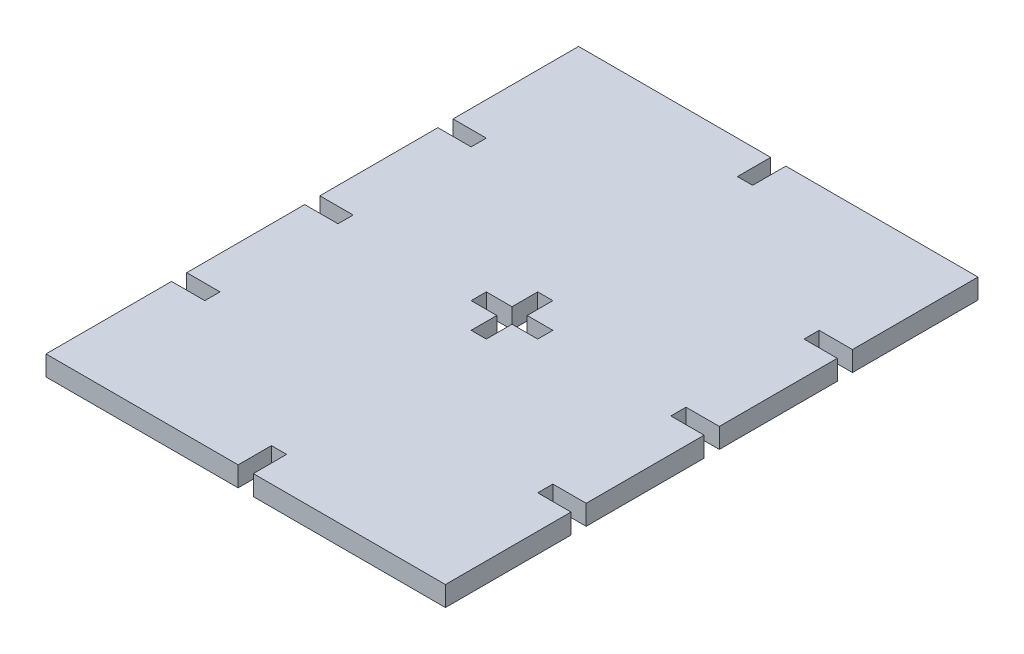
from build123d import *

# Parameters (mm, degrees)
SKETCH1_W           = 60
SKETCH1_H           = 80
BOSS_EXTRUDE1_DEPTH = 3
SKETCH2_W           = 2.28
SKETCH2_H           = 10
SKETCH2_W_2         = 10
SKETCH2_H_2         = 2.28
CUT_EXTRUDE2_DEPTH  = 3
SKETCH3_W           = 10
SKETCH3_H           = 2.28
SKETCH3_W_2         = 2.28
SKETCH3_H_2         = 10
CUT_EXTRUDE4_DEPTH  = 10


with BuildPart() as part:
    # Sketch1 → Boss-Extrude1 (new body)
    with BuildSketch(Plane(origin=(0, 0, 0), x_dir=(1, 0, 0), z_dir=(0, 1, 0))):
        Rectangle(SKETCH1_W, SKETCH1_H)
    extrude(amount=BOSS_EXTRUDE1_DEPTH)

    # Sketch2 → Cut-Extrude2 (cut)
    with BuildSketch(Plane(origin=(0, 3, 0), x_dir=(1, 0, 0), z_dir=(0, 1, 0))):
        with Locations((0, 40)):
            Rectangle(SKETCH2_W, SKETCH2_H)
        with Locations((30, 0)):
            Rectangle(SKETCH2_W_2, SKETCH2_H_2)
        with Locations((30, -20)):
            Rectangle(SKETCH2_W_2, SKETCH2_H_2)
        with Locations((30, 20)):
            Rectangle(SKETCH2_W_2, SKETCH2_H_2)
        with Locations((-30, -20)):
            Rectangle(SKETCH2_W_2, SKETCH2_H_2)
        with Locations((-30, 0)):
            Rectangle(SKETCH2_W_2, SKETCH2_H_2)
        with Locations((-30, 20)):
            Rectangle(SKETCH2_W_2, SKETCH2_H_2)
        with Locations((0, -40)):
            Rectangle(SKETCH2_W, SKETCH2_H)
    extrude(amount=-CUT_EXTRUDE2_DEPTH, mode=Mode.SUBTRACT)

    # Sketch3 → Cut-Extrude4 (cut)
    with BuildSketch(Plane(origin=(0, 3, 0), x_dir=(1, 0, 0), z_dir=(0, 1, 0))):
        Rectangle(SKETCH3_W, SKETCH3_H)
        Rectangle(SKETCH3_W_2, SKETCH3_H_2)
    extrude(amount=-CUT_EXTRUDE4_DEPTH, mode=Mode.SUBTRACT)


solid = part.part
